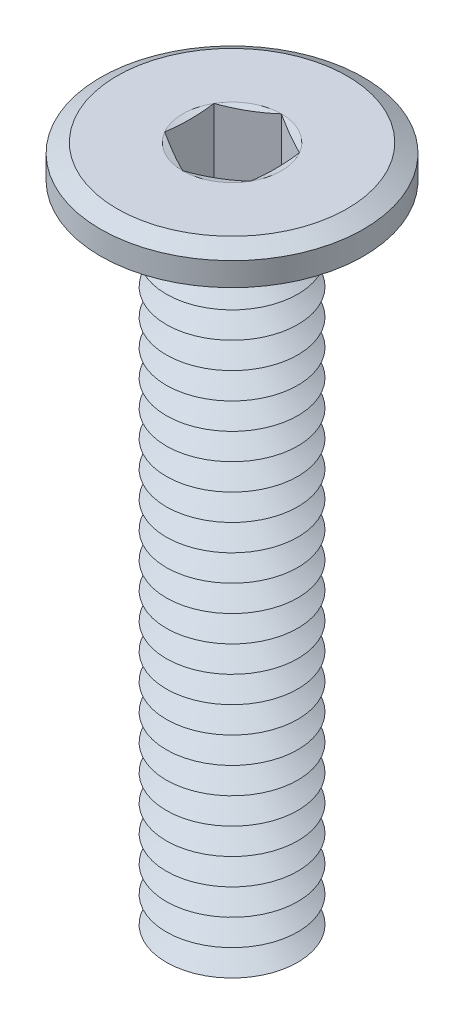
from build123d import *

# Parameters (mm, degrees)
SKETCH1_R           = 2
BOSS_EXTRUDE1_DEPTH = 0.5
SKETCH2_R           = 1
BOSS_EXTRUDE2_DEPTH = 10
LPATTERN1_COUNT     = 24
LPATTERN1_PITCH     = 0.4
FILLET1_R           = 0.1
CHAMFER2_SIZE       = 0.25
CHAMFER2_SIZE2      = 0.144337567
CUT_EXTRUDE1_DEPTH  = 1.2


with BuildPart() as part:
    # Sketch1 → Boss-Extrude1 (new body)
    with BuildSketch(Plane(origin=(0, 0, 0), x_dir=(1, 0, 0), z_dir=(0, 1, 0))):
        with Locations(Location((0, 0, 0), (0, 0, 270))):
            Circle(SKETCH1_R)
    extrude(amount=-BOSS_EXTRUDE1_DEPTH)

    # Sketch2 → Boss-Extrude2 (add)
    with BuildSketch(Plane.XZ.offset(0.5)):
        with Locations(Location((0, 0, 0), (0, 0, 270))):
            Circle(SKETCH2_R)
    extrude(amount=BOSS_EXTRUDE2_DEPTH)

    # Sketch5 → Cut-Revolve1 (revolve, cut)
    with BuildSketch(Plane(origin=(0, 0, 0), x_dir=(0, 0, -1), z_dir=(1, 0, 0))):
        Polygon((-1, -10.7), (-0.653589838, -10.5), (-1, -10.3), align=None)
    cut_revolve1 = revolve(axis=Axis((0, 0.990593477, 0), (0, -1, 0)), mode=Mode.SUBTRACT)

    # LPattern1: Cut-Revolve1 ×24
    with Locations(*[(0, i * LPATTERN1_PITCH, 0) for i in range(1, LPATTERN1_COUNT)]):
        add(cut_revolve1, mode=Mode.SUBTRACT)

    # Fillet1
    fillet1_edges = [part.edges().sort_by_distance(p)[0] for p in [
        (0, -0.5, 1),
    ]]
    fillet(fillet1_edges, radius=FILLET1_R)

    # Chamfer2
    chamfer2_edges = [part.edges().sort_by_distance(p)[0] for p in [
        (0, 0, -2),
    ]]
    chamfer2_side = [part.faces().sort_by_distance(p)[0] for p in [
        (0, 0, 0),
    ]]
    chamfer(chamfer2_edges, length=CHAMFER2_SIZE, length2=CHAMFER2_SIZE2, reference=chamfer2_side[0])

    # Sketch6 → Cut-Extrude1 (cut)
    with BuildSketch(Plane(origin=(0, 0, 0), x_dir=(1, 0, 0), z_dir=(0, 1, 0))):
        Polygon((0, 0.75055535), (-0.65, 0.375277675), (-0.65, -0.375277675), (0, -0.75055535), (0.65, -0.375277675), (0.65, 0.375277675), align=None)
    extrude(amount=-CUT_EXTRUDE1_DEPTH, mode=Mode.SUBTRACT)

    # Cut-Extrude2 cone 1 section (on through the dimple's axis) → Cut-Extrude2 (revolve, cut)
    with BuildSketch(Plane(origin=(0, -1.2, 0), x_dir=(0, 0, 1), z_dir=(1, 0, 0))):
        Polygon((0, 0), (0.65, 0), (0, 0.375277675), align=None)
    revolve(axis=Axis((0, -1.2, 0), (0, -1, 0)), mode=Mode.SUBTRACT)

    # Cut-Extrude3 cone 1 section (on through the dimple's axis) → Cut-Extrude3 (revolve, cut)
    with BuildSketch(Plane(origin=(0, 0, 0), x_dir=(0, 0, 1), z_dir=(1, 0, 0))):
        Polygon((0, 0), (0.75055535, 0), (0, 0.2011107), align=None)
    revolve(axis=Axis((0, 0, 0), (0, -1, 0)), mode=Mode.SUBTRACT)


solid = part.part
